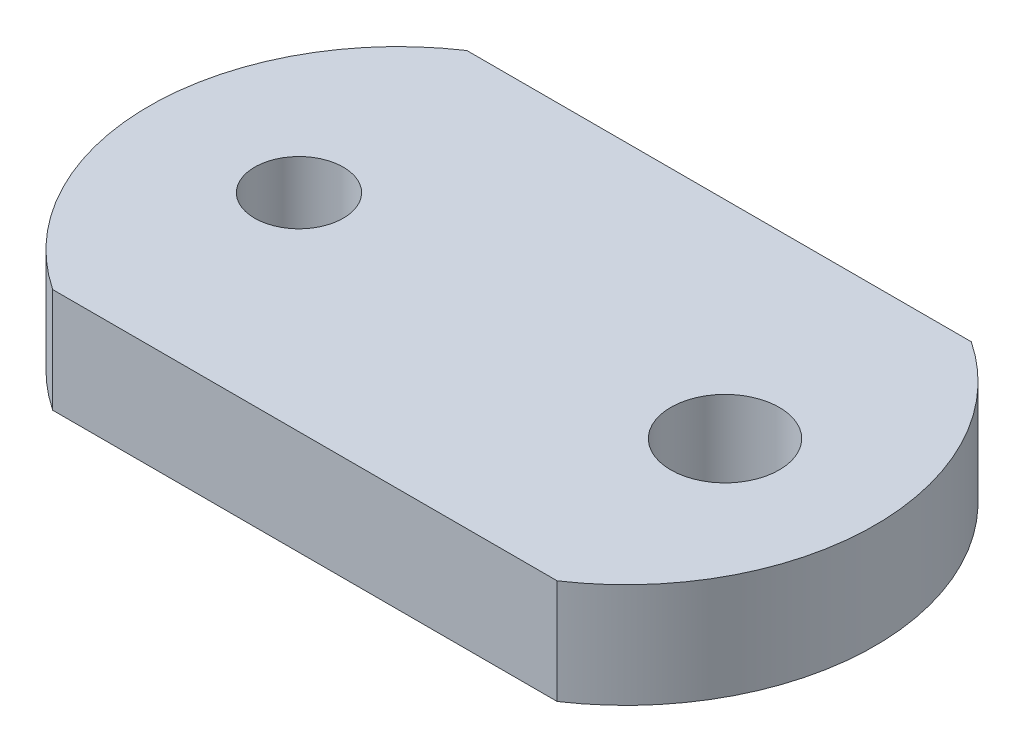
from build123d import *

# Parameters (mm, degrees)
BOSS_EXTRUDE1_DEPTH = 2.3368
SKETCH3_R           = 1.9812
SKETCH3_R_2         = 2.4257
CUT_EXTRUDE1_DEPTH  = 20.261127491


with BuildPart() as part:
    # Sketch1 → Boss-Extrude1 (new, symmetric)
    with BuildSketch(Plane(origin=(0, 0, 0), x_dir=(1, 0, 0), z_dir=(0, 1, 0))):
        with BuildLine():
            Line((-11.2776, -9.2583), (11.2776, -9.2583))
            ThreePointArc((11.2776, -9.2583), (16.2306, 0), (11.2776, 9.2583))
            Line((11.2776, 9.2583), (-11.2776, 9.2583))
            ThreePointArc((-11.2776, 9.2583), (-16.2306, 0), (-11.2776, -9.2583))
        make_face()
    extrude(amount=BOSS_EXTRUDE1_DEPTH, both=True)

    # Sketch3 → Cut-Extrude1 (cut, through all)
    with BuildSketch(Plane(origin=(0, 2.3368, 0), x_dir=(1, 0, 0), z_dir=(0, 1, 0))):
        with Locations(Location((-9.525, 0, 0), (0, 0, 270))):
            Circle(SKETCH3_R)
        with Locations(Location((9.525, 0, 0), (0, 0, 270))):
            Circle(SKETCH3_R_2)
    extrude(amount=-CUT_EXTRUDE1_DEPTH, mode=Mode.SUBTRACT)


solid = part.part
